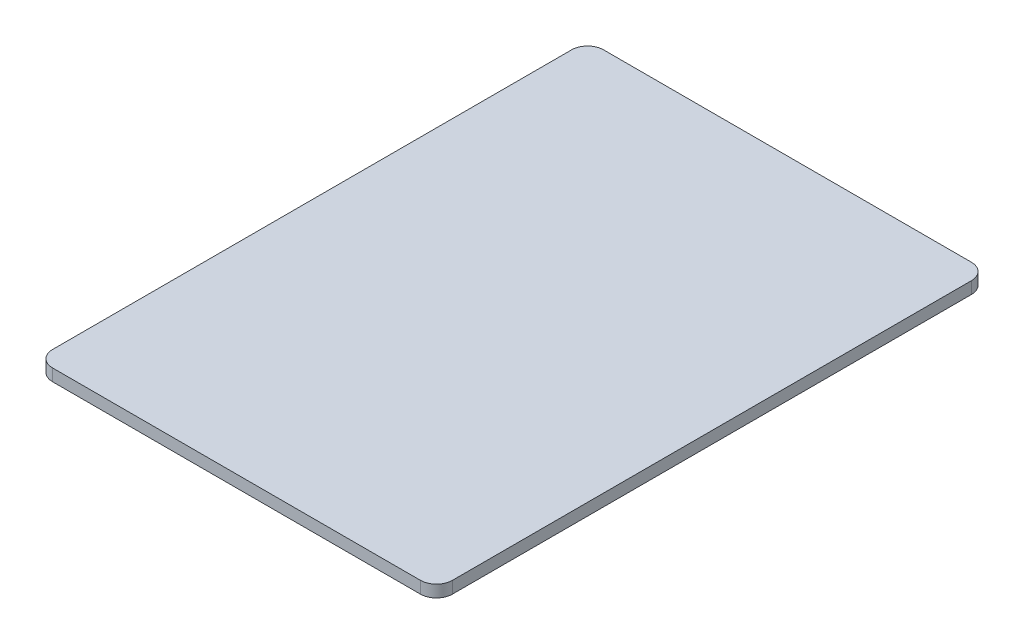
from build123d import *

# Parameters (mm, degrees)
SKETCH1_W           = 254
SKETCH1_H           = 350.012
BOSS_EXTRUDE1_DEPTH = 7.62
FILLET1_R           = 10.16
CUT_EXTRUDE1_DEPTH  = 7.62


with BuildPart() as part:
    # Sketch1 → Boss-Extrude1 (new body)
    with BuildSketch(Plane(origin=(0, 0, 0), x_dir=(1, 0, 0), z_dir=(0, 1, 0))):
        with Locations((127, 175.006)):
            Rectangle(SKETCH1_W, SKETCH1_H)
    extrude(amount=BOSS_EXTRUDE1_DEPTH)

    # Fillet1
    fillet1_edges = [part.edges().sort_by_distance(p)[0] for p in [
        (0, 3.81, -350.012),
        (254, 3.81, -350.012),
        (254, 3.81, 0),
        (0, 3.81, 0),
    ]]
    fillet(fillet1_edges, radius=FILLET1_R)

    # Sketch2 → Cut-Extrude1 (cut)
    with BuildSketch(Plane.ZY):
        with BuildLine():
            Line((-200.406, 5.08), (-149.606, 5.08))
            ThreePointArc((-149.606, 5.08), (-144.526, 0), (-149.606, -5.08))
            Line((-149.606, -5.08), (-200.406, -5.08))
            ThreePointArc((-200.406, -5.08), (-205.486, 0), (-200.406, 5.08))
        make_face()
    extrude(amount=-CUT_EXTRUDE1_DEPTH, mode=Mode.SUBTRACT)


solid = part.part
